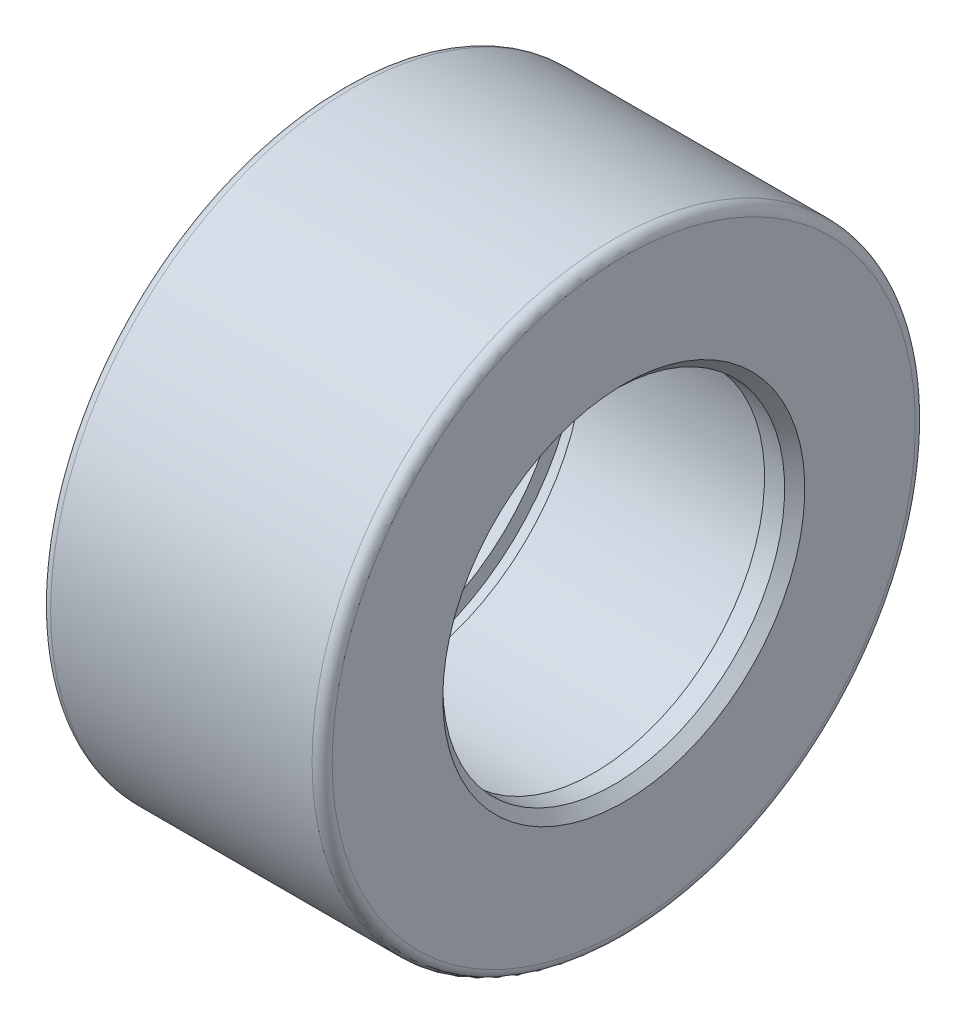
from build123d import *

# Parameters (mm, degrees)
CONG_1_R        = 0.5
CHANFREIN1_SIZE = 0.5


with BuildPart() as part:
    # Esquisse1 → R_volution1 (revolve)
    with BuildSketch(Plane.XY, mode=Mode.PRIVATE) as r_volution1_sk:
        Polygon((0, 8.5), (0, 15), (-14, 15), (-14, 9.5), (-12.5, 9.5), (-12.5, 10.25), (-11.5, 10.25), (-11.5, 9.5), (-1.5, 9.5), (-1.5, 8.5), align=None)
    revolve(r_volution1_sk.sketch.rotate(Axis((-21.014273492, 0, 0), (1, 0, 0)), 90), axis=Axis((-21.014273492, 0, 0), (1, 0, 0)))

    # Cong_1
    cong_1_edges = [part.edges().sort_by_distance(p)[0] for p in [
        (-14, 0, -15),
        (0, 0, -15),
    ]]
    fillet(cong_1_edges, radius=CONG_1_R)

    # Chanfrein1
    chanfrein1_edges = [part.edges().sort_by_distance(p)[0] for p in [
        (-14, 0, -9.5),
        (0, 0, -8.5),
    ]]
    chamfer(chanfrein1_edges, length=CHANFREIN1_SIZE)


solid = part.part
